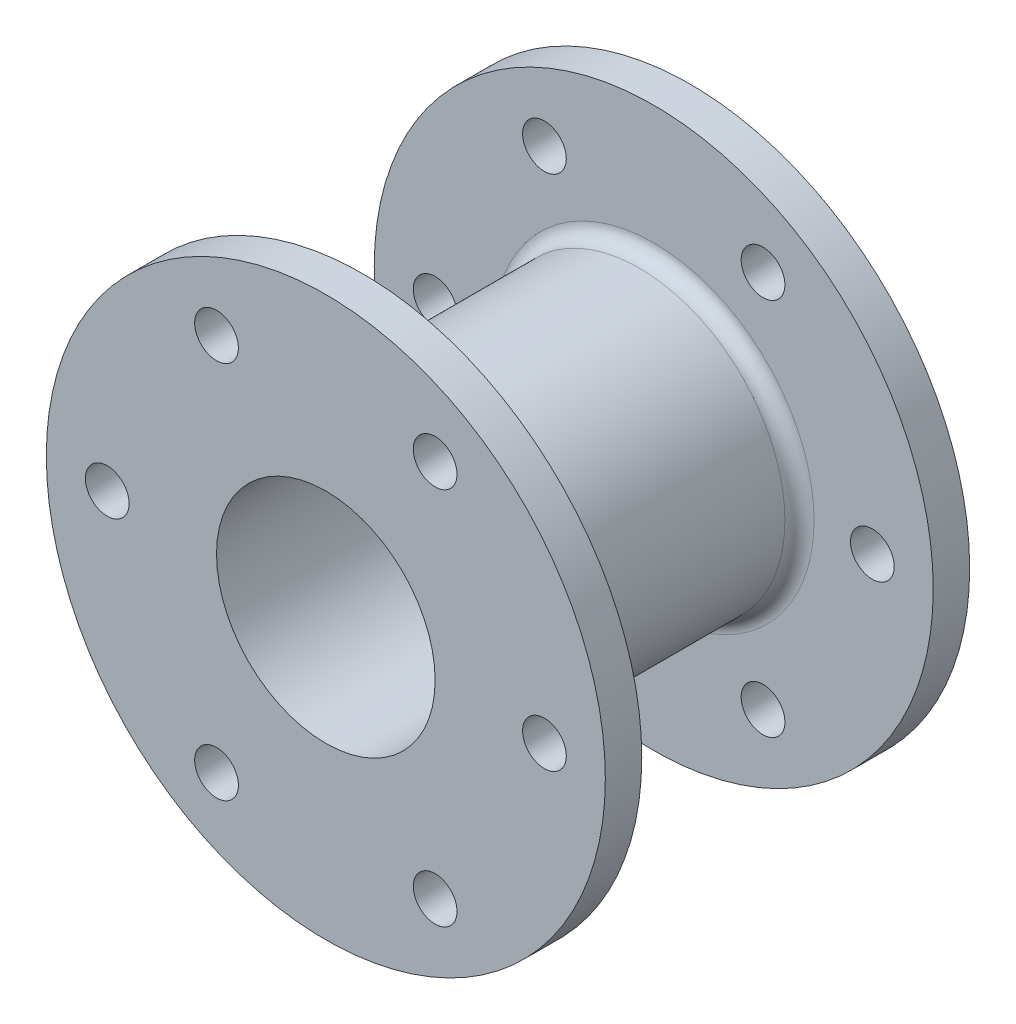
from build123d import *

# Parameters (mm, degrees)
SKETCH1_R           = 38.358056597
SKETCH1_R_2         = 3
BOSS_EXTRUDE1_DEPTH = 5
SKETCH2_R           = 20
SKETCH2_R_2         = 15
BOSS_EXTRUDE2_DEPTH = 45
CUT_EXTRUDE1_START  = -50
SKETCH3_R           = 15
CUT_EXTRUDE1_DEPTH  = 50
BOSS_EXTRUDE3_START = -5
SKETCH4_R           = 38.358056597
SKETCH4_R_2         = 3
SKETCH4_R_3         = 15
BOSS_EXTRUDE3_DEPTH = 5
FILLET1_R           = 2


with BuildPart() as part:
    # Sketch1 → Boss-Extrude1 (new body)
    with BuildSketch(Plane.XY):
        Circle(SKETCH1_R)
        with Locations((-30, 0)):
            Circle(SKETCH1_R_2, mode=Mode.SUBTRACT)
        with Locations((-15, 25.980762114)):
            Circle(SKETCH1_R_2, mode=Mode.SUBTRACT)
        with Locations((15, 25.980762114)):
            Circle(SKETCH1_R_2, mode=Mode.SUBTRACT)
        with Locations((30, 0)):
            Circle(SKETCH1_R_2, mode=Mode.SUBTRACT)
        with Locations((15, -25.980762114)):
            Circle(SKETCH1_R_2, mode=Mode.SUBTRACT)
        with Locations((-15, -25.980762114)):
            Circle(SKETCH1_R_2, mode=Mode.SUBTRACT)
    extrude(amount=BOSS_EXTRUDE1_DEPTH)

    # Sketch2 → Boss-Extrude2 (add)
    with BuildSketch(Plane.XY.offset(5)):
        with Locations(Location((0, 0, 0), (0, 0, 180))):
            Circle(SKETCH2_R)
        with Locations(Location((0, 0, 0), (0, 0, 180))):
            Circle(SKETCH2_R_2, mode=Mode.SUBTRACT)
    extrude(amount=BOSS_EXTRUDE2_DEPTH)

    # Sketch3 → Cut-Extrude1 (cut)
    with BuildSketch(Plane.XY.offset(5).offset(CUT_EXTRUDE1_START)):
        with Locations(Location((0, 0, 0), (0, 0, 180))):
            Circle(SKETCH3_R)
    extrude(amount=CUT_EXTRUDE1_DEPTH, mode=Mode.SUBTRACT)

    # Sketch4 → Boss-Extrude3 (add)
    with BuildSketch(Plane.XY.offset(50).offset(BOSS_EXTRUDE3_START)):
        Circle(SKETCH4_R)
        with Locations((-15, -25.980762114)):
            Circle(SKETCH4_R_2, mode=Mode.SUBTRACT)
        with Locations((15, -25.980762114)):
            Circle(SKETCH4_R_2, mode=Mode.SUBTRACT)
        with Locations((30, 0)):
            Circle(SKETCH4_R_2, mode=Mode.SUBTRACT)
        with Locations((15, 25.980762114)):
            Circle(SKETCH4_R_2, mode=Mode.SUBTRACT)
        with Locations((-15, 25.980762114)):
            Circle(SKETCH4_R_2, mode=Mode.SUBTRACT)
        with Locations((-30, 0)):
            Circle(SKETCH4_R_2, mode=Mode.SUBTRACT)
        with Locations(Location((0, 0, 0), (0, 0, 180))):
            Circle(SKETCH4_R_3, mode=Mode.SUBTRACT)
    extrude(amount=BOSS_EXTRUDE3_DEPTH)

    # Fillet1
    fillet1_edges = [part.edges().sort_by_distance(p)[0] for p in [
        (20, 0, 5),
        (20, 0, 45),
    ]]
    fillet(fillet1_edges, radius=FILLET1_R)


solid = part.part
